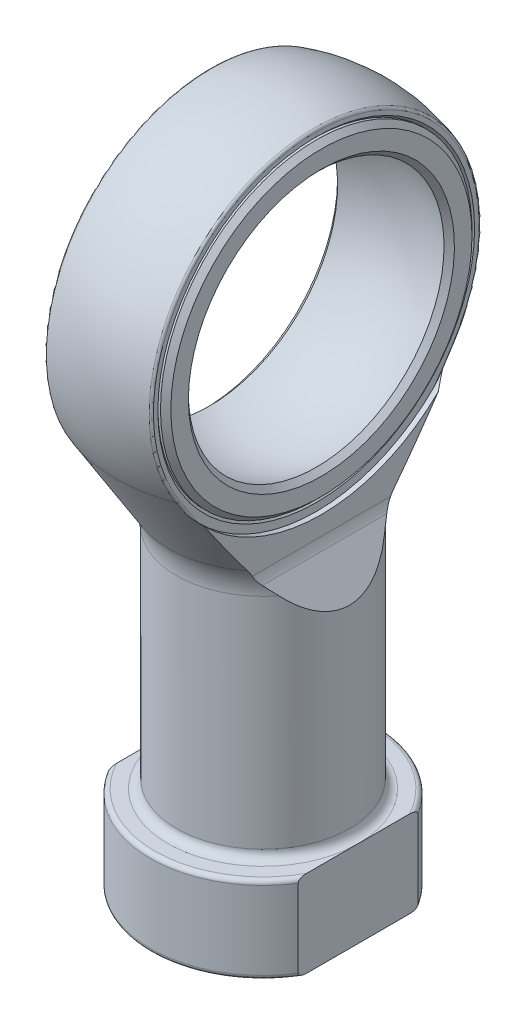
from build123d import *

# Parameters (mm, degrees)
ENL_V_MAT_EXTRU_1_DEPTH = 25
ENL_V_START             = -50
ESQUISSE7_R             = 9
ENL_V_MAT_EXTRU_3_DEPTH = 50
ESQUISSE8_R             = 9.6
ENL_V_MAT_EXTRU_4_DEPTH = 0.3
ESQUISSE9_R             = 9.6
ENL_V_MAT_EXTRU_5_DEPTH = 0.3
CHANFREIN1_SIZE         = 0.15
CONG_2_R                = 0.15


with BuildPart() as part:
    # Esquisse6 → R_volution3 (revolve)
    with BuildSketch(Plane.XY, mode=Mode.PRIVATE) as r_volution3_sk:
        with BuildLine():
            Line((-3.075, 9), (3.075, 9))
            Line((3.075, 9), (3.375, 8.7))
            Line((3.375, 8.7), (3.375, 7.685416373))
            Line((3.375, 7.685416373), (3.075, 7.385416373))
            ThreePointArc((3.075, 7.385416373), (0, 8), (-3.075, 7.385416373))
            Line((-3.075, 7.385416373), (-3.375, 7.685416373))
            Line((-3.375, 7.685416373), (-3.375, 8.7))
            Line((-3.375, 8.7), (-3.075, 9))
        make_face()
    revolve(r_volution3_sk.sketch.rotate(Axis((0, 0, 0), (1, 0, 0)), 90), axis=Axis((0, 0, 0), (1, 0, 0)))


with BuildPart() as body_2:
    # Esquisse2 → R_volution2 (revolve)
    with BuildSketch(Plane.XY):
        with BuildLine():
            Line((0, 10), (0, 5))
            ThreePointArc((0, 5), (-5, 0), (0, -5))
            Line((0, -5), (0, -13.267949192))
            Line((0, -13.267949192), (-3, -15))
            Line((-3, -15), (-3, -30))
            Line((-3, -30), (-6.25, -30))
            ThreePointArc((-6.25, -30), (-6.426776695, -29.926776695), (-6.5, -29.75))
            Line((-6.5, -29.75), (-6.5, -25.25))
            ThreePointArc((-6.5, -25.25), (-6.426776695, -25.073223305), (-6.25, -25))
            Line((-6.25, -25), (-5.5, -25))
            ThreePointArc((-5.5, -25), (-5.146446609, -24.853553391), (-5, -24.5))
            Line((-5, -24.5), (-5, -11.843534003))
            ThreePointArc((-5, -11.843534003), (-5.111992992, -11.031489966), (-5.439610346, -10.280074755))
            Line((-5.439610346, -10.280074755), (-8.534632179, -5.211530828))
            ThreePointArc((-8.534632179, -5.211530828), (-8.721103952, 4.893091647), (0, 10))
        make_face()
    revolve(axis=Axis((0, 10, 0), (0, -1, 0)))

    # Esquisse3 → Enl_v. mat.-Extru.1 (cut, symmetric)
    with BuildSketch(Plane.XY):
        with BuildLine():
            Line((-3.375, 21.146850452), (-3.375, -10.684701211))
            ThreePointArc((-3.375, -10.684701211), (-3.421283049, -10.985407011), (-3.555847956, -11.258277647))
            Line((-3.555847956, -11.258277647), (-5.5, -14.034814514))
            Line((-5.5, -14.034814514), (-5.5, -47.712981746))
            Line((-5.5, -47.712981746), (-20.469528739, -48.710950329))
            Line((-20.469528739, -48.710950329), (-20.469528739, 21.146850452))
            Line((-20.469528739, 21.146850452), (-3.375, 21.146850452))
        make_face()
        with BuildLine():
            Line((20.469528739, 21.146850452), (3.375, 21.146850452))
            Line((3.375, 21.146850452), (3.375, -10.684701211))
            ThreePointArc((3.375, -10.684701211), (3.421283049, -10.985407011), (3.555847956, -11.258277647))
            Line((3.555847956, -11.258277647), (5.5, -14.034814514))
            Line((5.5, -14.034814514), (5.5, -47.712981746))
            Line((5.5, -47.712981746), (20.469528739, -48.710950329))
            Line((20.469528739, -48.710950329), (20.469528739, 21.146850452))
        make_face()
    extrude(amount=ENL_V_MAT_EXTRU_1_DEPTH, both=True, mode=Mode.SUBTRACT)

    # Esquisse7 → Enl_v. mat.-Extru.3 (cut)
    with BuildSketch(Plane.ZY.offset(3.375).offset(ENL_V_START)):
        with Locations(Location((0, 0, 0), (0, 0, 270))):
            Circle(ESQUISSE7_R)
    extrude(amount=ENL_V_MAT_EXTRU_3_DEPTH, mode=Mode.SUBTRACT)

    # Esquisse8 → Enl_v. mat.-Extru.4 (cut)
    with BuildSketch(Plane.ZY.offset(3.375)):
        Circle(ESQUISSE8_R)
    extrude(amount=-ENL_V_MAT_EXTRU_4_DEPTH, mode=Mode.SUBTRACT)

    # Esquisse9 → Enl_v. mat.-Extru.5 (cut)
    with BuildSketch(Plane(origin=(3.375, 0, 0), x_dir=(0, 0, -1), z_dir=(1, 0, 0))):
        Circle(ESQUISSE9_R)
    extrude(amount=-ENL_V_MAT_EXTRU_5_DEPTH, mode=Mode.SUBTRACT)

    # Chanfrein1
    chanfrein1_edges = [body_2.edges().sort_by_distance(p)[0] for p in [
        (-3.075, 9, 0),
        (3.075, 9, 0),
    ]]
    chamfer(chanfrein1_edges, length=CHANFREIN1_SIZE)

    # Cong_2
    cong_2_edges = [body_2.edges().sort_by_distance(p)[0] for p in [
        (-3.075, 4.525160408, -8.370621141),
        (-3.075, -5.754480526, 7.604935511),
        (-3.075, -5.754480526, -7.604935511),
        (3.075, -5.754480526, -7.604935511),
        (3.075, -5.754480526, 7.604935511),
        (3.075, 9.515480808, 0),
    ]]
    fillet(cong_2_edges, radius=CONG_2_R)


solid = Compound([part.part, body_2.part])
